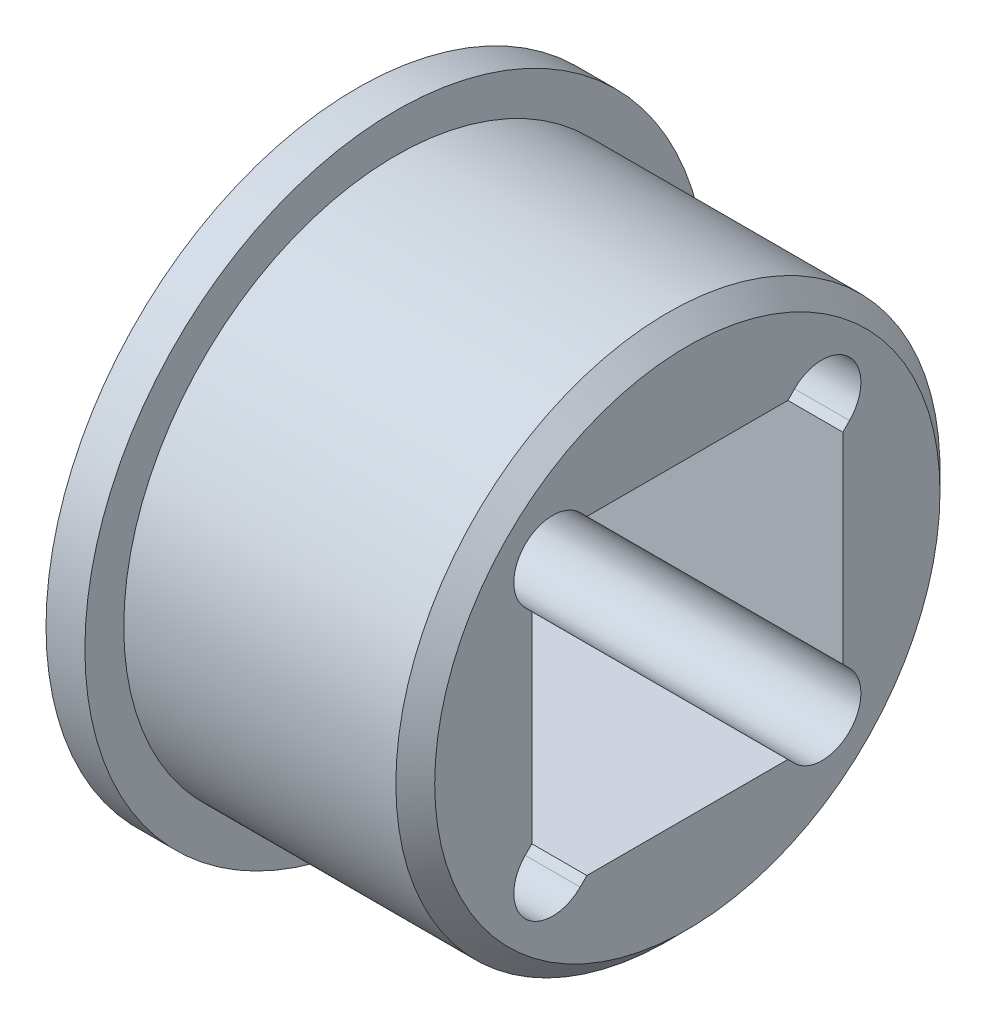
ISO-10303-21;
HEADER;
FILE_DESCRIPTION(('STEP AP214'),'2;1');
FILE_NAME('part.step','',(''),(''),'','','');
FILE_SCHEMA(('AUTOMOTIVE_DESIGN { 1 0 10303 214 1 1 1 1 }'));
ENDSEC;
DATA;
#1=APPLICATION_CONTEXT('core data for automotive mechanical design processes');
#2=APPLICATION_PROTOCOL_DEFINITION('international standard','automotive_design',2000,#1);
#3=PRODUCT_CONTEXT('',#1,'mechanical');
#4=PRODUCT('Part','Part','',(#3));
#5=PRODUCT_RELATED_PRODUCT_CATEGORY('part','',(#4));
#6=PRODUCT_DEFINITION_FORMATION('','',#4);
#7=PRODUCT_DEFINITION_CONTEXT('part definition',#1,'design');
#8=PRODUCT_DEFINITION('design','',#6,#7);
#9=PRODUCT_DEFINITION_SHAPE('','',#8);
#10=(LENGTH_UNIT() NAMED_UNIT(*) SI_UNIT(.MILLI.,.METRE.));
#11=(NAMED_UNIT(*) PLANE_ANGLE_UNIT() SI_UNIT($,.RADIAN.));
#12=(NAMED_UNIT(*) SI_UNIT($,.STERADIAN.) SOLID_ANGLE_UNIT());
#13=UNCERTAINTY_MEASURE_WITH_UNIT(LENGTH_MEASURE(1.E-05),#10,'distance_accuracy_value','');
#14=(GEOMETRIC_REPRESENTATION_CONTEXT(3) GLOBAL_UNCERTAINTY_ASSIGNED_CONTEXT((#13)) GLOBAL_UNIT_ASSIGNED_CONTEXT((#10,
#11,#12)) REPRESENTATION_CONTEXT('',''));
#15=CARTESIAN_POINT('',(0.,0.,0.));
#16=DIRECTION('',(0.,0.,1.));
#17=DIRECTION('',(1.,0.,0.));
#18=AXIS2_PLACEMENT_3D('',#15,#16,#17);
#19=CARTESIAN_POINT('',(0.,0.,0.));
#20=DIRECTION('',(1.,0.,0.));
#21=DIRECTION('',(0.,0.,-1.));
#22=AXIS2_PLACEMENT_3D('',#19,#20,#21);
#23=PLANE('',#22);
#24=DIRECTION('',(0.,0.,1.));
#25=VECTOR('',#24,1.);
#26=CARTESIAN_POINT('',(0.,8.,8.));
#27=LINE('',#26,#25);
#28=CARTESIAN_POINT('',(0.,8.,-5.17157287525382));
#29=VERTEX_POINT('',#28);
#30=CARTESIAN_POINT('',(0.,8.,5.17157287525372));
#31=VERTEX_POINT('',#30);
#32=EDGE_CURVE('E268',#29,#31,#27,.T.);
#33=ORIENTED_EDGE('',*,*,#32,.T.);
#34=DIRECTION('',(0.,0.707106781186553,0.707106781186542));
#35=VECTOR('',#34,1.);
#36=CARTESIAN_POINT('',(0.,8.34386001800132,5.51543289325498));
#37=LINE('',#36,#35);
#38=CARTESIAN_POINT('',(0.,8.34386001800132,5.51543289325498));
#39=VERTEX_POINT('',#38);
#40=EDGE_CURVE('E49',#31,#39,#37,.T.);
#41=ORIENTED_EDGE('',*,*,#40,.T.);
#42=CARTESIAN_POINT('',(0.,6.92964645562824,6.92964645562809));
#43=DIRECTION('',(1.,0.,0.));
#44=DIRECTION('',(0.,0.,-1.));
#45=AXIS2_PLACEMENT_3D('',#42,#43,#44);
#46=CIRCLE('',#45,2.);
#47=CARTESIAN_POINT('',(0.,5.51543289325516,8.34386001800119));
#48=VERTEX_POINT('',#47);
#49=EDGE_CURVE('E151',#39,#48,#46,.T.);
#50=ORIENTED_EDGE('',*,*,#49,.T.);
#51=DIRECTION('',(0.,-0.707106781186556,-0.707106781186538));
#52=VECTOR('',#51,1.);
#53=CARTESIAN_POINT('',(0.,5.51543289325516,8.34386001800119));
#54=LINE('',#53,#52);
#55=CARTESIAN_POINT('',(0.,5.1715728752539,7.99999999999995));
#56=VERTEX_POINT('',#55);
#57=EDGE_CURVE('E159',#48,#56,#54,.T.);
#58=ORIENTED_EDGE('',*,*,#57,.T.);
#59=DIRECTION('',(0.,-1.,0.));
#60=VECTOR('',#59,1.);
#61=CARTESIAN_POINT('',(0.,8.,8.));
#62=LINE('',#61,#60);
#63=CARTESIAN_POINT('',(0.,-5.17157287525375,8.00000000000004));
#64=VERTEX_POINT('',#63);
#65=EDGE_CURVE('E261',#56,#64,#62,.T.);
#66=ORIENTED_EDGE('',*,*,#65,.T.);
#67=DIRECTION('',(0.,-0.707106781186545,0.70710678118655));
#68=VECTOR('',#67,1.);
#69=CARTESIAN_POINT('',(0.,-5.51543289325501,8.3438600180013));
#70=LINE('',#69,#68);
#71=CARTESIAN_POINT('',(0.,-5.51543289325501,8.3438600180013));
#72=VERTEX_POINT('',#71);
#73=EDGE_CURVE('E189',#64,#72,#70,.T.);
#74=ORIENTED_EDGE('',*,*,#73,.T.);
#75=CARTESIAN_POINT('',(0.,-6.92964645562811,6.92964645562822));
#76=DIRECTION('',(1.,0.,0.));
#77=DIRECTION('',(0.,0.,-1.));
#78=AXIS2_PLACEMENT_3D('',#75,#76,#77);
#79=CIRCLE('',#78,2.);
#80=CARTESIAN_POINT('',(0.,-8.34386001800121,5.51543289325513));
#81=VERTEX_POINT('',#80);
#82=EDGE_CURVE('E182',#72,#81,#79,.T.);
#83=ORIENTED_EDGE('',*,*,#82,.T.);
#84=DIRECTION('',(0.,0.707106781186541,-0.707106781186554));
#85=VECTOR('',#84,1.);
#86=CARTESIAN_POINT('',(0.,-8.34386001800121,5.51543289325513));
#87=LINE('',#86,#85);
#88=CARTESIAN_POINT('',(0.,-7.99999999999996,5.17157287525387));
#89=VERTEX_POINT('',#88);
#90=EDGE_CURVE('E185',#81,#89,#87,.T.);
#91=ORIENTED_EDGE('',*,*,#90,.T.);
#92=DIRECTION('',(0.,0.,-1.));
#93=VECTOR('',#92,1.);
#94=CARTESIAN_POINT('',(0.,-8.,8.));
#95=LINE('',#94,#93);
#96=CARTESIAN_POINT('',(0.,-8.,-5.17157287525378));
#97=VERTEX_POINT('',#96);
#98=EDGE_CURVE('E263',#89,#97,#95,.T.);
#99=ORIENTED_EDGE('',*,*,#98,.T.);
#100=DIRECTION('',(0.,-0.707106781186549,-0.707106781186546));
#101=VECTOR('',#100,1.);
#102=CARTESIAN_POINT('',(0.,-8.34386001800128,-5.51543289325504));
#103=LINE('',#102,#101);
#104=CARTESIAN_POINT('',(0.,-8.34386001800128,-5.51543289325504));
#105=VERTEX_POINT('',#104);
#106=EDGE_CURVE('E214',#97,#105,#103,.T.);
#107=ORIENTED_EDGE('',*,*,#106,.T.);
#108=CARTESIAN_POINT('',(0.,-6.92964645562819,-6.92964645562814));
#109=DIRECTION('',(1.,0.,0.));
#110=DIRECTION('',(0.,0.,-1.));
#111=AXIS2_PLACEMENT_3D('',#108,#109,#110);
#112=CIRCLE('',#111,2.);
#113=CARTESIAN_POINT('',(0.,-5.5154328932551,-8.34386001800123));
#114=VERTEX_POINT('',#113);
#115=EDGE_CURVE('E207',#105,#114,#112,.T.);
#116=ORIENTED_EDGE('',*,*,#115,.T.);
#117=DIRECTION('',(0.,0.707106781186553,0.707106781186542));
#118=VECTOR('',#117,1.);
#119=CARTESIAN_POINT('',(0.,-5.5154328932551,-8.34386001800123));
#120=LINE('',#119,#118);
#121=CARTESIAN_POINT('',(0.,-5.17157287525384,-7.99999999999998));
#122=VERTEX_POINT('',#121);
#123=EDGE_CURVE('E210',#114,#122,#120,.T.);
#124=ORIENTED_EDGE('',*,*,#123,.T.);
#125=DIRECTION('',(0.,1.,0.));
#126=VECTOR('',#125,1.);
#127=CARTESIAN_POINT('',(0.,8.,-8.));
#128=LINE('',#127,#126);
#129=CARTESIAN_POINT('',(0.,5.17157287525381,-8.));
#130=VERTEX_POINT('',#129);
#131=EDGE_CURVE('E266',#122,#130,#128,.T.);
#132=ORIENTED_EDGE('',*,*,#131,.T.);
#133=DIRECTION('',(0.,0.707106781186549,-0.707106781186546));
#134=VECTOR('',#133,1.);
#135=CARTESIAN_POINT('',(0.,5.51543289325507,-8.34386001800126));
#136=LINE('',#135,#134);
#137=CARTESIAN_POINT('',(0.,5.51543289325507,-8.34386001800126));
#138=VERTEX_POINT('',#137);
#139=EDGE_CURVE('E241',#130,#138,#136,.T.);
#140=ORIENTED_EDGE('',*,*,#139,.T.);
#141=CARTESIAN_POINT('',(0.,6.92964645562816,-6.92964645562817));
#142=DIRECTION('',(1.,0.,0.));
#143=DIRECTION('',(0.,0.,-1.));
#144=AXIS2_PLACEMENT_3D('',#141,#142,#143);
#145=CIRCLE('',#144,2.);
#146=CARTESIAN_POINT('',(0.,8.34386001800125,-5.51543289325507));
#147=VERTEX_POINT('',#146);
#148=EDGE_CURVE('E234',#138,#147,#145,.T.);
#149=ORIENTED_EDGE('',*,*,#148,.T.);
#150=DIRECTION('',(0.,-0.707106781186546,0.707106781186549));
#151=VECTOR('',#150,1.);
#152=CARTESIAN_POINT('',(0.,8.34386001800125,-5.51543289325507));
#153=LINE('',#152,#151);
#154=EDGE_CURVE('E237',#147,#29,#153,.T.);
#155=ORIENTED_EDGE('',*,*,#154,.T.);
#156=EDGE_LOOP('',(#33,#41,#50,#58,#66,#74,#83,#91,#99,#107,#116,#124,#132,#140,#149,#155));
#157=FACE_BOUND('',#156,.T.);
#158=CARTESIAN_POINT('',(0.,0.,0.));
#159=DIRECTION('',(-1.,0.,0.));
#160=DIRECTION('',(0.,0.,1.));
#161=AXIS2_PLACEMENT_3D('',#158,#159,#160);
#162=CIRCLE('',#161,16.);
#163=CARTESIAN_POINT('',(0.,0.,16.));
#164=VERTEX_POINT('',#163);
#165=EDGE_CURVE('E283',#164,#164,#162,.T.);
#166=ORIENTED_EDGE('',*,*,#165,.T.);
#167=EDGE_LOOP('',(#166));
#168=FACE_BOUND('',#167,.T.);
#169=ADVANCED_FACE('F34',(#157,#168),#23,.F.);
#170=CARTESIAN_POINT('',(-19.0972157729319,0.,0.));
#171=DIRECTION('',(-1.,0.,0.));
#172=DIRECTION('',(0.,0.,1.));
#173=AXIS2_PLACEMENT_3D('',#170,#171,#172);
#174=CYLINDRICAL_SURFACE('',#173,16.);
#175=ORIENTED_EDGE('',*,*,#165,.F.);
#176=EDGE_LOOP('',(#175));
#177=FACE_BOUND('',#176,.T.);
#178=CARTESIAN_POINT('',(2.,0.,0.));
#179=DIRECTION('',(-1.,0.,0.));
#180=DIRECTION('',(0.,0.,1.));
#181=AXIS2_PLACEMENT_3D('',#178,#179,#180);
#182=CIRCLE('',#181,16.);
#183=CARTESIAN_POINT('',(2.,0.,16.));
#184=VERTEX_POINT('',#183);
#185=EDGE_CURVE('E280',#184,#184,#182,.T.);
#186=ORIENTED_EDGE('',*,*,#185,.T.);
#187=EDGE_LOOP('',(#186));
#188=FACE_BOUND('',#187,.T.);
#189=ADVANCED_FACE('F308',(#177,#188),#174,.T.);
#190=CARTESIAN_POINT('',(2.,-16.,1.1172740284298E-13));
#191=DIRECTION('',(-1.,0.,0.));
#192=DIRECTION('',(0.,0.,1.));
#193=AXIS2_PLACEMENT_3D('',#190,#191,#192);
#194=PLANE('',#193);
#195=ORIENTED_EDGE('',*,*,#185,.F.);
#196=EDGE_LOOP('',(#195));
#197=FACE_BOUND('',#196,.T.);
#198=CARTESIAN_POINT('',(2.,0.,0.));
#199=DIRECTION('',(-1.,0.,0.));
#200=DIRECTION('',(0.,0.,1.));
#201=AXIS2_PLACEMENT_3D('',#198,#199,#200);
#202=CIRCLE('',#201,14.);
#203=CARTESIAN_POINT('',(2.,0.,14.));
#204=VERTEX_POINT('',#203);
#205=EDGE_CURVE('E270',#204,#204,#202,.T.);
#206=ORIENTED_EDGE('',*,*,#205,.T.);
#207=EDGE_LOOP('',(#206));
#208=FACE_BOUND('',#207,.T.);
#209=ADVANCED_FACE('F313',(#197,#208),#194,.F.);
#210=CARTESIAN_POINT('',(-19.0972157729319,0.,0.));
#211=DIRECTION('',(-1.,0.,0.));
#212=DIRECTION('',(0.,0.,1.));
#213=AXIS2_PLACEMENT_3D('',#210,#211,#212);
#214=CYLINDRICAL_SURFACE('',#213,14.);
#215=CARTESIAN_POINT('',(16.,0.,0.));
#216=DIRECTION('',(-1.,0.,0.));
#217=DIRECTION('',(0.,0.,1.));
#218=AXIS2_PLACEMENT_3D('',#215,#216,#217);
#219=CIRCLE('',#218,14.);
#220=CARTESIAN_POINT('',(16.,0.,14.));
#221=VERTEX_POINT('',#220);
#222=EDGE_CURVE('E42',#221,#221,#219,.T.);
#223=ORIENTED_EDGE('',*,*,#222,.T.);
#224=EDGE_LOOP('',(#223));
#225=FACE_BOUND('',#224,.T.);
#226=ORIENTED_EDGE('',*,*,#205,.F.);
#227=EDGE_LOOP('',(#226));
#228=FACE_BOUND('',#227,.T.);
#229=ADVANCED_FACE('F288',(#225,#228),#214,.T.);
#230=CARTESIAN_POINT('',(17.,0.,0.));
#231=DIRECTION('',(-1.,0.,0.));
#232=DIRECTION('',(0.,0.,1.));
#233=AXIS2_PLACEMENT_3D('',#230,#231,#232);
#234=PLANE('',#233);
#235=CARTESIAN_POINT('',(17.,0.,0.));
#236=DIRECTION('',(-1.,0.,0.));
#237=DIRECTION('',(0.,0.,1.));
#238=AXIS2_PLACEMENT_3D('',#235,#236,#237);
#239=CIRCLE('',#238,13.);
#240=CARTESIAN_POINT('',(17.,0.,13.));
#241=VERTEX_POINT('',#240);
#242=EDGE_CURVE('E11',#241,#241,#239,.F.);
#243=ORIENTED_EDGE('',*,*,#242,.T.);
#244=EDGE_LOOP('',(#243));
#245=FACE_BOUND('',#244,.T.);
#246=CARTESIAN_POINT('',(17.,6.92964645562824,6.92964645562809));
#247=DIRECTION('',(1.,0.,0.));
#248=DIRECTION('',(0.,0.,-1.));
#249=AXIS2_PLACEMENT_3D('',#246,#247,#248);
#250=CIRCLE('',#249,2.);
#251=CARTESIAN_POINT('',(17.,8.34386001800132,5.51543289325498));
#252=VERTEX_POINT('',#251);
#253=CARTESIAN_POINT('',(17.,5.51543289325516,8.34386001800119));
#254=VERTEX_POINT('',#253);
#255=EDGE_CURVE('E153',#252,#254,#250,.T.);
#256=ORIENTED_EDGE('',*,*,#255,.F.);
#257=DIRECTION('',(0.,0.707106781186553,0.707106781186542));
#258=VECTOR('',#257,1.);
#259=CARTESIAN_POINT('',(17.,8.34386001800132,5.51543289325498));
#260=LINE('',#259,#258);
#261=CARTESIAN_POINT('',(17.,8.00000000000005,5.17157287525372));
#262=VERTEX_POINT('',#261);
#263=EDGE_CURVE('E167',#262,#252,#260,.T.);
#264=ORIENTED_EDGE('',*,*,#263,.F.);
#265=DIRECTION('',(0.,0.,1.));
#266=VECTOR('',#265,1.);
#267=CARTESIAN_POINT('',(17.,8.,8.));
#268=LINE('',#267,#266);
#269=CARTESIAN_POINT('',(17.,8.,-5.17157287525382));
#270=VERTEX_POINT('',#269);
#271=EDGE_CURVE('E264',#270,#262,#268,.T.);
#272=ORIENTED_EDGE('',*,*,#271,.F.);
#273=DIRECTION('',(0.,-0.707106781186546,0.707106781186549));
#274=VECTOR('',#273,1.);
#275=CARTESIAN_POINT('',(17.,8.34386001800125,-5.51543289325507));
#276=LINE('',#275,#274);
#277=CARTESIAN_POINT('',(17.,8.34386001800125,-5.51543289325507));
#278=VERTEX_POINT('',#277);
#279=EDGE_CURVE('E247',#278,#270,#276,.T.);
#280=ORIENTED_EDGE('',*,*,#279,.F.);
#281=CARTESIAN_POINT('',(17.,6.92964645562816,-6.92964645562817));
#282=DIRECTION('',(1.,0.,0.));
#283=DIRECTION('',(0.,0.,-1.));
#284=AXIS2_PLACEMENT_3D('',#281,#282,#283);
#285=CIRCLE('',#284,2.);
#286=CARTESIAN_POINT('',(17.,5.51543289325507,-8.34386001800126));
#287=VERTEX_POINT('',#286);
#288=EDGE_CURVE('E226',#287,#278,#285,.T.);
#289=ORIENTED_EDGE('',*,*,#288,.F.);
#290=DIRECTION('',(0.,0.707106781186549,-0.707106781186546));
#291=VECTOR('',#290,1.);
#292=CARTESIAN_POINT('',(17.,5.51543289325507,-8.34386001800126));
#293=LINE('',#292,#291);
#294=CARTESIAN_POINT('',(17.,5.17157287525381,-8.));
#295=VERTEX_POINT('',#294);
#296=EDGE_CURVE('E238',#295,#287,#293,.T.);
#297=ORIENTED_EDGE('',*,*,#296,.F.);
#298=DIRECTION('',(0.,1.,0.));
#299=VECTOR('',#298,1.);
#300=CARTESIAN_POINT('',(17.,8.,-8.));
#301=LINE('',#300,#299);
#302=CARTESIAN_POINT('',(17.,-5.17157287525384,-7.99999999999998));
#303=VERTEX_POINT('',#302);
#304=EDGE_CURVE('E274',#303,#295,#301,.T.);
#305=ORIENTED_EDGE('',*,*,#304,.F.);
#306=DIRECTION('',(0.,0.707106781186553,0.707106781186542));
#307=VECTOR('',#306,1.);
#308=CARTESIAN_POINT('',(17.,-5.5154328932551,-8.34386001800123));
#309=LINE('',#308,#307);
#310=CARTESIAN_POINT('',(17.,-5.5154328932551,-8.34386001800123));
#311=VERTEX_POINT('',#310);
#312=EDGE_CURVE('E220',#311,#303,#309,.T.);
#313=ORIENTED_EDGE('',*,*,#312,.F.);
#314=CARTESIAN_POINT('',(17.,-6.92964645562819,-6.92964645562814));
#315=DIRECTION('',(1.,0.,0.));
#316=DIRECTION('',(0.,0.,-1.));
#317=AXIS2_PLACEMENT_3D('',#314,#315,#316);
#318=CIRCLE('',#317,2.);
#319=CARTESIAN_POINT('',(17.,-8.34386001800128,-5.51543289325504));
#320=VERTEX_POINT('',#319);
#321=EDGE_CURVE('E200',#320,#311,#318,.T.);
#322=ORIENTED_EDGE('',*,*,#321,.F.);
#323=DIRECTION('',(0.,-0.707106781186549,-0.707106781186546));
#324=VECTOR('',#323,1.);
#325=CARTESIAN_POINT('',(17.,-8.34386001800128,-5.51543289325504));
#326=LINE('',#325,#324);
#327=CARTESIAN_POINT('',(17.,-8.00000000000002,-5.17157287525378));
#328=VERTEX_POINT('',#327);
#329=EDGE_CURVE('E211',#328,#320,#326,.T.);
#330=ORIENTED_EDGE('',*,*,#329,.F.);
#331=DIRECTION('',(0.,0.,-1.));
#332=VECTOR('',#331,1.);
#333=CARTESIAN_POINT('',(17.,-8.,8.));
#334=LINE('',#333,#332);
#335=CARTESIAN_POINT('',(17.,-8.,5.17157287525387));
#336=VERTEX_POINT('',#335);
#337=EDGE_CURVE('E272',#336,#328,#334,.T.);
#338=ORIENTED_EDGE('',*,*,#337,.F.);
#339=DIRECTION('',(0.,0.707106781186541,-0.707106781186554));
#340=VECTOR('',#339,1.);
#341=CARTESIAN_POINT('',(17.,-8.34386001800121,5.51543289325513));
#342=LINE('',#341,#340);
#343=CARTESIAN_POINT('',(17.,-8.34386001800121,5.51543289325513));
#344=VERTEX_POINT('',#343);
#345=EDGE_CURVE('E57',#344,#336,#342,.T.);
#346=ORIENTED_EDGE('',*,*,#345,.F.);
#347=CARTESIAN_POINT('',(17.,-6.92964645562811,6.92964645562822));
#348=DIRECTION('',(1.,0.,0.));
#349=DIRECTION('',(0.,0.,-1.));
#350=AXIS2_PLACEMENT_3D('',#347,#348,#349);
#351=CIRCLE('',#350,2.);
#352=CARTESIAN_POINT('',(17.,-5.51543289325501,8.3438600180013));
#353=VERTEX_POINT('',#352);
#354=EDGE_CURVE('E178',#353,#344,#351,.T.);
#355=ORIENTED_EDGE('',*,*,#354,.F.);
#356=DIRECTION('',(0.,-0.707106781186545,0.70710678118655));
#357=VECTOR('',#356,1.);
#358=CARTESIAN_POINT('',(17.,-5.51543289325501,8.3438600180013));
#359=LINE('',#358,#357);
#360=CARTESIAN_POINT('',(17.,-5.17157287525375,8.00000000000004));
#361=VERTEX_POINT('',#360);
#362=EDGE_CURVE('E186',#361,#353,#359,.T.);
#363=ORIENTED_EDGE('',*,*,#362,.F.);
#364=DIRECTION('',(0.,-1.,0.));
#365=VECTOR('',#364,1.);
#366=CARTESIAN_POINT('',(17.,8.,8.));
#367=LINE('',#366,#365);
#368=CARTESIAN_POINT('',(17.,5.1715728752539,7.99999999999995));
#369=VERTEX_POINT('',#368);
#370=EDGE_CURVE('E253',#369,#361,#367,.T.);
#371=ORIENTED_EDGE('',*,*,#370,.F.);
#372=DIRECTION('',(0.,-0.707106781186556,-0.707106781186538));
#373=VECTOR('',#372,1.);
#374=CARTESIAN_POINT('',(17.,5.51543289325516,8.34386001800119));
#375=LINE('',#374,#373);
#376=EDGE_CURVE('E170',#254,#369,#375,.T.);
#377=ORIENTED_EDGE('',*,*,#376,.F.);
#378=EDGE_LOOP('',(#256,#264,#272,#280,#289,#297,#305,#313,#322,#330,#338,#346,#355,#363,#371,#377));
#379=FACE_BOUND('',#378,.T.);
#380=ADVANCED_FACE('F322',(#245,#379),#234,.F.);
#381=CARTESIAN_POINT('',(0.,8.,8.));
#382=DIRECTION('',(0.,0.,1.));
#383=DIRECTION('',(0.,-1.,0.));
#384=AXIS2_PLACEMENT_3D('',#381,#382,#383);
#385=PLANE('',#384);
#386=ORIENTED_EDGE('',*,*,#65,.F.);
#387=DIRECTION('',(1.,0.,0.));
#388=VECTOR('',#387,1.);
#389=CARTESIAN_POINT('',(0.,5.1715728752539,7.99999999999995));
#390=LINE('',#389,#388);
#391=EDGE_CURVE('E156',#56,#369,#390,.T.);
#392=ORIENTED_EDGE('',*,*,#391,.T.);
#393=ORIENTED_EDGE('',*,*,#370,.T.);
#394=DIRECTION('',(1.,0.,0.));
#395=VECTOR('',#394,1.);
#396=CARTESIAN_POINT('',(0.,-5.17157287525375,8.00000000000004));
#397=LINE('',#396,#395);
#398=EDGE_CURVE('E201',#64,#361,#397,.T.);
#399=ORIENTED_EDGE('',*,*,#398,.F.);
#400=EDGE_LOOP('',(#386,#392,#393,#399));
#401=FACE_BOUND('',#400,.T.);
#402=ADVANCED_FACE('F324',(#401),#385,.F.);
#403=CARTESIAN_POINT('',(0.,8.,8.));
#404=DIRECTION('',(0.,1.,0.));
#405=DIRECTION('',(0.,0.,1.));
#406=AXIS2_PLACEMENT_3D('',#403,#404,#405);
#407=PLANE('',#406);
#408=ORIENTED_EDGE('',*,*,#271,.T.);
#409=DIRECTION('',(1.,0.,0.));
#410=VECTOR('',#409,1.);
#411=CARTESIAN_POINT('',(0.,8.00000000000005,5.17157287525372));
#412=LINE('',#411,#410);
#413=EDGE_CURVE('E179',#31,#262,#412,.T.);
#414=ORIENTED_EDGE('',*,*,#413,.F.);
#415=ORIENTED_EDGE('',*,*,#32,.F.);
#416=DIRECTION('',(1.,0.,0.));
#417=VECTOR('',#416,1.);
#418=CARTESIAN_POINT('',(0.,8.,-5.17157287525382));
#419=LINE('',#418,#417);
#420=EDGE_CURVE('E257',#29,#270,#419,.T.);
#421=ORIENTED_EDGE('',*,*,#420,.T.);
#422=EDGE_LOOP('',(#408,#414,#415,#421));
#423=FACE_BOUND('',#422,.T.);
#424=ADVANCED_FACE('F327',(#423),#407,.F.);
#425=CARTESIAN_POINT('',(0.,8.,-8.));
#426=DIRECTION('',(0.,0.,-1.));
#427=DIRECTION('',(-1.,0.,0.));
#428=AXIS2_PLACEMENT_3D('',#425,#426,#427);
#429=PLANE('',#428);
#430=ORIENTED_EDGE('',*,*,#131,.F.);
#431=DIRECTION('',(1.,0.,0.));
#432=VECTOR('',#431,1.);
#433=CARTESIAN_POINT('',(0.,-5.17157287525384,-7.99999999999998));
#434=LINE('',#433,#432);
#435=EDGE_CURVE('E230',#122,#303,#434,.T.);
#436=ORIENTED_EDGE('',*,*,#435,.T.);
#437=ORIENTED_EDGE('',*,*,#304,.T.);
#438=DIRECTION('',(1.,0.,0.));
#439=VECTOR('',#438,1.);
#440=CARTESIAN_POINT('',(0.,5.17157287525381,-8.));
#441=LINE('',#440,#439);
#442=EDGE_CURVE('E254',#130,#295,#441,.T.);
#443=ORIENTED_EDGE('',*,*,#442,.F.);
#444=EDGE_LOOP('',(#430,#436,#437,#443));
#445=FACE_BOUND('',#444,.T.);
#446=ADVANCED_FACE('F303',(#445),#429,.F.);
#447=CARTESIAN_POINT('',(0.,-8.,8.));
#448=DIRECTION('',(0.,-1.,0.));
#449=DIRECTION('',(0.,0.,-1.));
#450=AXIS2_PLACEMENT_3D('',#447,#448,#449);
#451=PLANE('',#450);
#452=ORIENTED_EDGE('',*,*,#98,.F.);
#453=DIRECTION('',(1.,0.,0.));
#454=VECTOR('',#453,1.);
#455=CARTESIAN_POINT('',(0.,-7.99999999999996,5.17157287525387));
#456=LINE('',#455,#454);
#457=EDGE_CURVE('E204',#89,#336,#456,.T.);
#458=ORIENTED_EDGE('',*,*,#457,.T.);
#459=ORIENTED_EDGE('',*,*,#337,.T.);
#460=DIRECTION('',(1.,0.,0.));
#461=VECTOR('',#460,1.);
#462=CARTESIAN_POINT('',(0.,-8.00000000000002,-5.17157287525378));
#463=LINE('',#462,#461);
#464=EDGE_CURVE('E227',#97,#328,#463,.T.);
#465=ORIENTED_EDGE('',*,*,#464,.F.);
#466=EDGE_LOOP('',(#452,#458,#459,#465));
#467=FACE_BOUND('',#466,.T.);
#468=ADVANCED_FACE('F293',(#467),#451,.F.);
#469=CARTESIAN_POINT('',(16.,0.,0.));
#470=DIRECTION('',(-1.,0.,0.));
#471=DIRECTION('',(0.,0.,1.));
#472=AXIS2_PLACEMENT_3D('',#469,#470,#471);
#473=CONICAL_SURFACE('',#472,14.,0.785398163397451);
#474=ORIENTED_EDGE('',*,*,#242,.F.);
#475=EDGE_LOOP('',(#474));
#476=FACE_BOUND('',#475,.T.);
#477=ORIENTED_EDGE('',*,*,#222,.F.);
#478=EDGE_LOOP('',(#477));
#479=FACE_BOUND('',#478,.T.);
#480=ADVANCED_FACE('F36',(#476,#479),#473,.T.);
#481=CARTESIAN_POINT('',(0.,6.92964645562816,-6.92964645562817));
#482=DIRECTION('',(1.,0.,0.));
#483=DIRECTION('',(0.,0.,-1.));
#484=AXIS2_PLACEMENT_3D('',#481,#482,#483);
#485=CYLINDRICAL_SURFACE('',#484,2.);
#486=ORIENTED_EDGE('',*,*,#288,.T.);
#487=DIRECTION('',(1.,0.,0.));
#488=VECTOR('',#487,1.);
#489=CARTESIAN_POINT('',(0.,8.34386001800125,-5.51543289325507));
#490=LINE('',#489,#488);
#491=EDGE_CURVE('E244',#147,#278,#490,.T.);
#492=ORIENTED_EDGE('',*,*,#491,.F.);
#493=ORIENTED_EDGE('',*,*,#148,.F.);
#494=DIRECTION('',(1.,0.,0.));
#495=VECTOR('',#494,1.);
#496=CARTESIAN_POINT('',(0.,5.51543289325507,-8.34386001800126));
#497=LINE('',#496,#495);
#498=EDGE_CURVE('E251',#138,#287,#497,.T.);
#499=ORIENTED_EDGE('',*,*,#498,.T.);
#500=EDGE_LOOP('',(#486,#492,#493,#499));
#501=FACE_BOUND('',#500,.T.);
#502=ADVANCED_FACE('F292',(#501),#485,.F.);
#503=CARTESIAN_POINT('',(0.,5.51543289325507,-8.34386001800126));
#504=DIRECTION('',(0.,-0.707106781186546,-0.707106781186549));
#505=DIRECTION('',(0.,0.707106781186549,-0.707106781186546));
#506=AXIS2_PLACEMENT_3D('',#503,#504,#505);
#507=PLANE('',#506);
#508=ORIENTED_EDGE('',*,*,#296,.T.);
#509=ORIENTED_EDGE('',*,*,#498,.F.);
#510=ORIENTED_EDGE('',*,*,#139,.F.);
#511=ORIENTED_EDGE('',*,*,#442,.T.);
#512=EDGE_LOOP('',(#508,#509,#510,#511));
#513=FACE_BOUND('',#512,.T.);
#514=ADVANCED_FACE('F299',(#513),#507,.F.);
#515=CARTESIAN_POINT('',(0.,8.34386001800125,-5.51543289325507));
#516=DIRECTION('',(0.,0.707106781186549,0.707106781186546));
#517=DIRECTION('',(0.,-0.707106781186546,0.707106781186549));
#518=AXIS2_PLACEMENT_3D('',#515,#516,#517);
#519=PLANE('',#518);
#520=ORIENTED_EDGE('',*,*,#279,.T.);
#521=ORIENTED_EDGE('',*,*,#420,.F.);
#522=ORIENTED_EDGE('',*,*,#154,.F.);
#523=ORIENTED_EDGE('',*,*,#491,.T.);
#524=EDGE_LOOP('',(#520,#521,#522,#523));
#525=FACE_BOUND('',#524,.T.);
#526=ADVANCED_FACE('F336',(#525),#519,.F.);
#527=CARTESIAN_POINT('',(0.,-6.92964645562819,-6.92964645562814));
#528=DIRECTION('',(1.,0.,0.));
#529=DIRECTION('',(0.,0.,-1.));
#530=AXIS2_PLACEMENT_3D('',#527,#528,#529);
#531=CYLINDRICAL_SURFACE('',#530,2.);
#532=ORIENTED_EDGE('',*,*,#321,.T.);
#533=DIRECTION('',(1.,0.,0.));
#534=VECTOR('',#533,1.);
#535=CARTESIAN_POINT('',(0.,-5.5154328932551,-8.34386001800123));
#536=LINE('',#535,#534);
#537=EDGE_CURVE('E217',#114,#311,#536,.T.);
#538=ORIENTED_EDGE('',*,*,#537,.F.);
#539=ORIENTED_EDGE('',*,*,#115,.F.);
#540=DIRECTION('',(1.,0.,0.));
#541=VECTOR('',#540,1.);
#542=CARTESIAN_POINT('',(0.,-8.34386001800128,-5.51543289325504));
#543=LINE('',#542,#541);
#544=EDGE_CURVE('E224',#105,#320,#543,.T.);
#545=ORIENTED_EDGE('',*,*,#544,.T.);
#546=EDGE_LOOP('',(#532,#538,#539,#545));
#547=FACE_BOUND('',#546,.T.);
#548=ADVANCED_FACE('F339',(#547),#531,.F.);
#549=CARTESIAN_POINT('',(0.,-8.34386001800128,-5.51543289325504));
#550=DIRECTION('',(0.,-0.707106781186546,0.707106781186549));
#551=DIRECTION('',(0.,-0.707106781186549,-0.707106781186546));
#552=AXIS2_PLACEMENT_3D('',#549,#550,#551);
#553=PLANE('',#552);
#554=ORIENTED_EDGE('',*,*,#329,.T.);
#555=ORIENTED_EDGE('',*,*,#544,.F.);
#556=ORIENTED_EDGE('',*,*,#106,.F.);
#557=ORIENTED_EDGE('',*,*,#464,.T.);
#558=EDGE_LOOP('',(#554,#555,#556,#557));
#559=FACE_BOUND('',#558,.T.);
#560=ADVANCED_FACE('F346',(#559),#553,.F.);
#561=CARTESIAN_POINT('',(0.,-5.5154328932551,-8.34386001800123));
#562=DIRECTION('',(0.,0.707106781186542,-0.707106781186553));
#563=DIRECTION('',(0.,0.707106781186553,0.707106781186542));
#564=AXIS2_PLACEMENT_3D('',#561,#562,#563);
#565=PLANE('',#564);
#566=ORIENTED_EDGE('',*,*,#312,.T.);
#567=ORIENTED_EDGE('',*,*,#435,.F.);
#568=ORIENTED_EDGE('',*,*,#123,.F.);
#569=ORIENTED_EDGE('',*,*,#537,.T.);
#570=EDGE_LOOP('',(#566,#567,#568,#569));
#571=FACE_BOUND('',#570,.T.);
#572=ADVANCED_FACE('F348',(#571),#565,.F.);
#573=CARTESIAN_POINT('',(0.,-6.92964645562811,6.92964645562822));
#574=DIRECTION('',(1.,0.,0.));
#575=DIRECTION('',(0.,0.,-1.));
#576=AXIS2_PLACEMENT_3D('',#573,#574,#575);
#577=CYLINDRICAL_SURFACE('',#576,2.);
#578=ORIENTED_EDGE('',*,*,#354,.T.);
#579=DIRECTION('',(1.,0.,0.));
#580=VECTOR('',#579,1.);
#581=CARTESIAN_POINT('',(0.,-8.34386001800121,5.51543289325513));
#582=LINE('',#581,#580);
#583=EDGE_CURVE('E192',#81,#344,#582,.T.);
#584=ORIENTED_EDGE('',*,*,#583,.F.);
#585=ORIENTED_EDGE('',*,*,#82,.F.);
#586=DIRECTION('',(1.,0.,0.));
#587=VECTOR('',#586,1.);
#588=CARTESIAN_POINT('',(0.,-5.51543289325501,8.3438600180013));
#589=LINE('',#588,#587);
#590=EDGE_CURVE('E198',#72,#353,#589,.T.);
#591=ORIENTED_EDGE('',*,*,#590,.T.);
#592=EDGE_LOOP('',(#578,#584,#585,#591));
#593=FACE_BOUND('',#592,.T.);
#594=ADVANCED_FACE('F351',(#593),#577,.F.);
#595=CARTESIAN_POINT('',(0.,-5.51543289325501,8.3438600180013));
#596=DIRECTION('',(0.,0.70710678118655,0.707106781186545));
#597=DIRECTION('',(0.,-0.707106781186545,0.70710678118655));
#598=AXIS2_PLACEMENT_3D('',#595,#596,#597);
#599=PLANE('',#598);
#600=ORIENTED_EDGE('',*,*,#362,.T.);
#601=ORIENTED_EDGE('',*,*,#590,.F.);
#602=ORIENTED_EDGE('',*,*,#73,.F.);
#603=ORIENTED_EDGE('',*,*,#398,.T.);
#604=EDGE_LOOP('',(#600,#601,#602,#603));
#605=FACE_BOUND('',#604,.T.);
#606=ADVANCED_FACE('F358',(#605),#599,.F.);
#607=CARTESIAN_POINT('',(0.,-8.34386001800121,5.51543289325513));
#608=DIRECTION('',(0.,-0.707106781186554,-0.707106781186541));
#609=DIRECTION('',(0.,0.707106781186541,-0.707106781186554));
#610=AXIS2_PLACEMENT_3D('',#607,#608,#609);
#611=PLANE('',#610);
#612=ORIENTED_EDGE('',*,*,#345,.T.);
#613=ORIENTED_EDGE('',*,*,#457,.F.);
#614=ORIENTED_EDGE('',*,*,#90,.F.);
#615=ORIENTED_EDGE('',*,*,#583,.T.);
#616=EDGE_LOOP('',(#612,#613,#614,#615));
#617=FACE_BOUND('',#616,.T.);
#618=ADVANCED_FACE('F360',(#617),#611,.F.);
#619=CARTESIAN_POINT('',(0.,6.92964645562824,6.92964645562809));
#620=DIRECTION('',(1.,0.,0.));
#621=DIRECTION('',(0.,0.,-1.));
#622=AXIS2_PLACEMENT_3D('',#619,#620,#621);
#623=CYLINDRICAL_SURFACE('',#622,2.);
#624=ORIENTED_EDGE('',*,*,#255,.T.);
#625=DIRECTION('',(1.,0.,0.));
#626=VECTOR('',#625,1.);
#627=CARTESIAN_POINT('',(0.,5.51543289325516,8.34386001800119));
#628=LINE('',#627,#626);
#629=EDGE_CURVE('E147',#48,#254,#628,.T.);
#630=ORIENTED_EDGE('',*,*,#629,.F.);
#631=ORIENTED_EDGE('',*,*,#49,.F.);
#632=DIRECTION('',(1.,0.,0.));
#633=VECTOR('',#632,1.);
#634=CARTESIAN_POINT('',(0.,8.34386001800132,5.51543289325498));
#635=LINE('',#634,#633);
#636=EDGE_CURVE('E176',#39,#252,#635,.T.);
#637=ORIENTED_EDGE('',*,*,#636,.T.);
#638=EDGE_LOOP('',(#624,#630,#631,#637));
#639=FACE_BOUND('',#638,.T.);
#640=ADVANCED_FACE('F149',(#639),#623,.F.);
#641=CARTESIAN_POINT('',(0.,8.34386001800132,5.51543289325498));
#642=DIRECTION('',(0.,0.707106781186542,-0.707106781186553));
#643=DIRECTION('',(0.,0.707106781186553,0.707106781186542));
#644=AXIS2_PLACEMENT_3D('',#641,#642,#643);
#645=PLANE('',#644);
#646=ORIENTED_EDGE('',*,*,#263,.T.);
#647=ORIENTED_EDGE('',*,*,#636,.F.);
#648=ORIENTED_EDGE('',*,*,#40,.F.);
#649=ORIENTED_EDGE('',*,*,#413,.T.);
#650=EDGE_LOOP('',(#646,#647,#648,#649));
#651=FACE_BOUND('',#650,.T.);
#652=ADVANCED_FACE('F368',(#651),#645,.F.);
#653=CARTESIAN_POINT('',(0.,5.51543289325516,8.34386001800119));
#654=DIRECTION('',(0.,-0.707106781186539,0.707106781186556));
#655=DIRECTION('',(0.,-0.707106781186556,-0.707106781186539));
#656=AXIS2_PLACEMENT_3D('',#653,#654,#655);
#657=PLANE('',#656);
#658=ORIENTED_EDGE('',*,*,#376,.T.);
#659=ORIENTED_EDGE('',*,*,#391,.F.);
#660=ORIENTED_EDGE('',*,*,#57,.F.);
#661=ORIENTED_EDGE('',*,*,#629,.T.);
#662=EDGE_LOOP('',(#658,#659,#660,#661));
#663=FACE_BOUND('',#662,.T.);
#664=ADVANCED_FACE('F160',(#663),#657,.F.);
#665=CLOSED_SHELL('',(#169,#189,#209,#229,#380,#402,#424,#446,#468,#480,#502,#514,#526,#548,
#560,#572,#594,#606,#618,#640,#652,#664));
#666=MANIFOLD_SOLID_BREP('B2',#665);
#667=ADVANCED_BREP_SHAPE_REPRESENTATION('',(#18,#666),#14);
#668=SHAPE_DEFINITION_REPRESENTATION(#9,#667);
ENDSEC;
END-ISO-10303-21;
